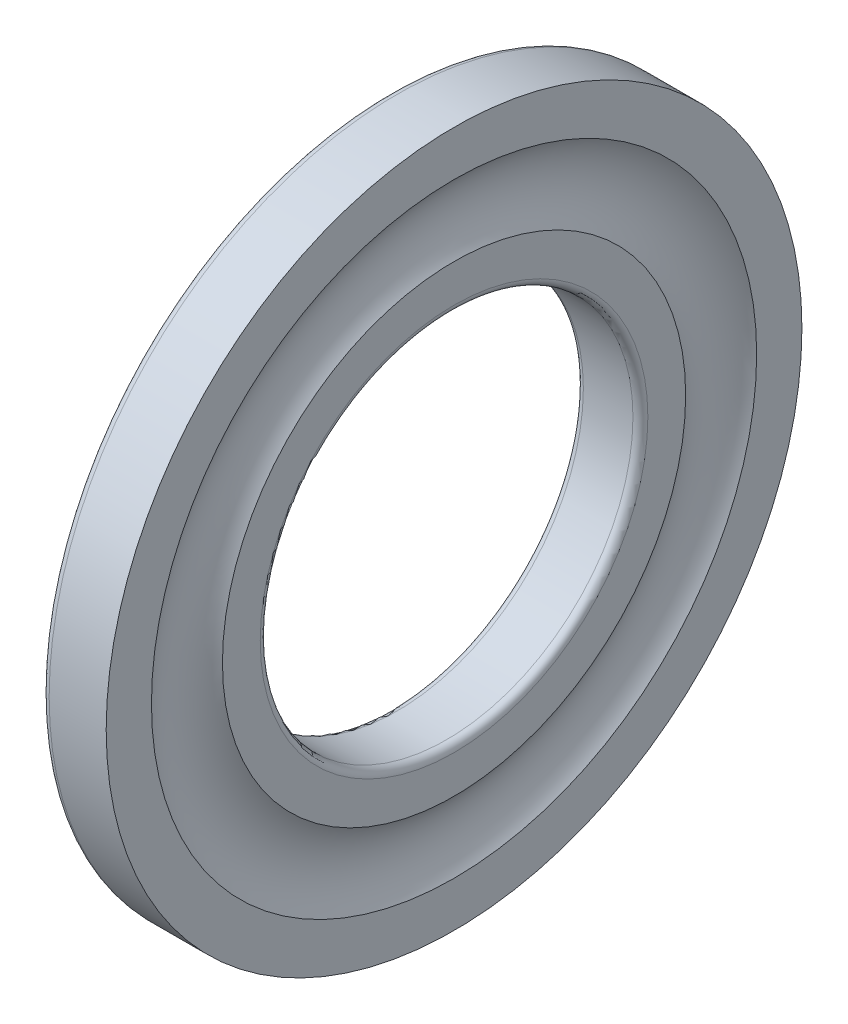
ISO-10303-21;
HEADER;
FILE_DESCRIPTION(('STEP AP214'),'2;1');
FILE_NAME('part.step','',(''),(''),'','','');
FILE_SCHEMA(('AUTOMOTIVE_DESIGN { 1 0 10303 214 1 1 1 1 }'));
ENDSEC;
DATA;
#1=APPLICATION_CONTEXT('core data for automotive mechanical design processes');
#2=APPLICATION_PROTOCOL_DEFINITION('international standard','automotive_design',2000,#1);
#3=PRODUCT_CONTEXT('',#1,'mechanical');
#4=PRODUCT('Part','Part','',(#3));
#5=PRODUCT_RELATED_PRODUCT_CATEGORY('part','',(#4));
#6=PRODUCT_DEFINITION_FORMATION('','',#4);
#7=PRODUCT_DEFINITION_CONTEXT('part definition',#1,'design');
#8=PRODUCT_DEFINITION('design','',#6,#7);
#9=PRODUCT_DEFINITION_SHAPE('','',#8);
#10=(LENGTH_UNIT() NAMED_UNIT(*) SI_UNIT(.MILLI.,.METRE.));
#11=(NAMED_UNIT(*) PLANE_ANGLE_UNIT() SI_UNIT($,.RADIAN.));
#12=(NAMED_UNIT(*) SI_UNIT($,.STERADIAN.) SOLID_ANGLE_UNIT());
#13=UNCERTAINTY_MEASURE_WITH_UNIT(LENGTH_MEASURE(1.E-05),#10,'distance_accuracy_value','');
#14=(GEOMETRIC_REPRESENTATION_CONTEXT(3) GLOBAL_UNCERTAINTY_ASSIGNED_CONTEXT((#13)) GLOBAL_UNIT_ASSIGNED_CONTEXT((#10,
#11,#12)) REPRESENTATION_CONTEXT('',''));
#15=CARTESIAN_POINT('',(0.,0.,0.));
#16=DIRECTION('',(0.,0.,1.));
#17=DIRECTION('',(1.,0.,0.));
#18=AXIS2_PLACEMENT_3D('',#15,#16,#17);
#19=CARTESIAN_POINT('',(0.,-13.9544959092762,-13.7));
#20=DIRECTION('',(-1.,0.,0.));
#21=DIRECTION('',(0.,0.,1.));
#22=AXIS2_PLACEMENT_3D('',#19,#20,#21);
#23=PLANE('',#22);
#24=CARTESIAN_POINT('',(0.,0.,0.));
#25=DIRECTION('',(-1.,0.,0.));
#26=DIRECTION('',(0.,0.,-1.));
#27=AXIS2_PLACEMENT_3D('',#24,#25,#26);
#28=CIRCLE('',#27,13.7);
#29=CARTESIAN_POINT('',(0.,0.,-13.7));
#30=VERTEX_POINT('',#29);
#31=EDGE_CURVE('E47',#30,#30,#28,.F.);
#32=ORIENTED_EDGE('',*,*,#31,.F.);
#33=EDGE_LOOP('',(#32));
#34=FACE_BOUND('',#33,.T.);
#35=CARTESIAN_POINT('',(0.,0.,0.));
#36=DIRECTION('',(1.,0.,0.));
#37=DIRECTION('',(0.,0.,1.));
#38=AXIS2_PLACEMENT_3D('',#35,#36,#37);
#39=CIRCLE('',#38,7.8);
#40=CARTESIAN_POINT('',(0.,0.,7.8));
#41=VERTEX_POINT('',#40);
#42=EDGE_CURVE('E44',#41,#41,#39,.T.);
#43=ORIENTED_EDGE('',*,*,#42,.T.);
#44=EDGE_LOOP('',(#43));
#45=FACE_BOUND('',#44,.T.);
#46=ADVANCED_FACE('F15',(#34,#45),#23,.T.);
#47=CARTESIAN_POINT('',(2.5952,-9.57609752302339,9.3214));
#48=DIRECTION('',(1.,0.,0.));
#49=DIRECTION('',(0.,0.,-1.));
#50=AXIS2_PLACEMENT_3D('',#47,#48,#49);
#51=PLANE('',#50);
#52=CARTESIAN_POINT('',(2.5952,0.,0.));
#53=DIRECTION('',(1.,0.,0.));
#54=DIRECTION('',(0.,-1.16848049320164E-09,1.));
#55=AXIS2_PLACEMENT_3D('',#52,#53,#54);
#56=CIRCLE('',#55,9.3214);
#57=CARTESIAN_POINT('',(2.5952,-1.08918740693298E-08,9.3214));
#58=VERTEX_POINT('',#57);
#59=EDGE_CURVE('E41',#58,#58,#56,.T.);
#60=ORIENTED_EDGE('',*,*,#59,.T.);
#61=EDGE_LOOP('',(#60));
#62=FACE_BOUND('',#61,.T.);
#63=CARTESIAN_POINT('',(2.5952,0.,0.));
#64=DIRECTION('',(-1.,0.,0.));
#65=DIRECTION('',(0.,0.,-1.));
#66=AXIS2_PLACEMENT_3D('',#63,#64,#65);
#67=CIRCLE('',#66,7.80000003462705);
#68=CARTESIAN_POINT('',(2.5952,0.,-7.80000003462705));
#69=VERTEX_POINT('',#68);
#70=EDGE_CURVE('E38',#69,#69,#67,.F.);
#71=ORIENTED_EDGE('',*,*,#70,.F.);
#72=EDGE_LOOP('',(#71));
#73=FACE_BOUND('',#72,.T.);
#74=ADVANCED_FACE('F55',(#62,#73),#51,.T.);
#75=CARTESIAN_POINT('',(2.5952,-14.260068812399,14.));
#76=DIRECTION('',(1.,0.,0.));
#77=DIRECTION('',(0.,0.,-1.));
#78=AXIS2_PLACEMENT_3D('',#75,#76,#77);
#79=PLANE('',#78);
#80=CARTESIAN_POINT('',(2.5952,0.,0.));
#81=DIRECTION('',(1.,0.,0.));
#82=DIRECTION('',(0.,0.,1.));
#83=AXIS2_PLACEMENT_3D('',#80,#81,#82);
#84=CIRCLE('',#83,14.);
#85=CARTESIAN_POINT('',(2.5952,0.,14.));
#86=VERTEX_POINT('',#85);
#87=EDGE_CURVE('E35',#86,#86,#84,.T.);
#88=ORIENTED_EDGE('',*,*,#87,.T.);
#89=EDGE_LOOP('',(#88));
#90=FACE_BOUND('',#89,.T.);
#91=CARTESIAN_POINT('',(2.5952,0.,0.));
#92=DIRECTION('',(-1.,0.,0.));
#93=DIRECTION('',(0.,0.,-1.));
#94=AXIS2_PLACEMENT_3D('',#91,#92,#93);
#95=CIRCLE('',#94,12.1786);
#96=CARTESIAN_POINT('',(2.5952,0.,-12.1786));
#97=VERTEX_POINT('',#96);
#98=EDGE_CURVE('E30',#97,#97,#95,.F.);
#99=ORIENTED_EDGE('',*,*,#98,.F.);
#100=EDGE_LOOP('',(#99));
#101=FACE_BOUND('',#100,.T.);
#102=ADVANCED_FACE('F62',(#90,#101),#79,.T.);
#103=CARTESIAN_POINT('',(0.299999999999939,0.,0.));
#104=DIRECTION('',(1.,0.,0.));
#105=DIRECTION('',(0.,0.,1.));
#106=AXIS2_PLACEMENT_3D('',#103,#104,#105);
#107=TOROIDAL_SURFACE('',#106,7.8,0.299999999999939);
#108=CARTESIAN_POINT('',(0.3,0.,0.));
#109=DIRECTION('',(1.,0.,0.));
#110=DIRECTION('',(0.,0.,1.));
#111=AXIS2_PLACEMENT_3D('',#108,#109,#110);
#112=CIRCLE('',#111,7.50000000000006);
#113=CARTESIAN_POINT('',(0.3,0.,7.50000000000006));
#114=VERTEX_POINT('',#113);
#115=EDGE_CURVE('E26',#114,#114,#112,.T.);
#116=ORIENTED_EDGE('',*,*,#115,.T.);
#117=EDGE_LOOP('',(#116));
#118=FACE_BOUND('',#117,.T.);
#119=ORIENTED_EDGE('',*,*,#42,.F.);
#120=EDGE_LOOP('',(#119));
#121=FACE_BOUND('',#120,.T.);
#122=ADVANCED_FACE('F59',(#118,#121),#107,.T.);
#123=CARTESIAN_POINT('',(2.5952,0.,0.));
#124=DIRECTION('',(1.,0.,0.));
#125=DIRECTION('',(0.,0.,1.));
#126=AXIS2_PLACEMENT_3D('',#123,#124,#125);
#127=CYLINDRICAL_SURFACE('',#126,7.5);
#128=CARTESIAN_POINT('',(2.2952,0.,0.));
#129=DIRECTION('',(1.,0.,0.));
#130=DIRECTION('',(0.,0.,1.));
#131=AXIS2_PLACEMENT_3D('',#128,#129,#130);
#132=CIRCLE('',#131,7.5);
#133=CARTESIAN_POINT('',(2.2952,0.,7.5));
#134=VERTEX_POINT('',#133);
#135=EDGE_CURVE('E22',#134,#134,#132,.T.);
#136=ORIENTED_EDGE('',*,*,#135,.T.);
#137=EDGE_LOOP('',(#136));
#138=FACE_BOUND('',#137,.T.);
#139=ORIENTED_EDGE('',*,*,#115,.F.);
#140=EDGE_LOOP('',(#139));
#141=FACE_BOUND('',#140,.T.);
#142=ADVANCED_FACE('F61',(#138,#141),#127,.F.);
#143=CARTESIAN_POINT('',(2.29520000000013,0.,0.));
#144=DIRECTION('',(1.,0.,0.));
#145=DIRECTION('',(0.,0.,1.));
#146=AXIS2_PLACEMENT_3D('',#143,#144,#145);
#147=TOROIDAL_SURFACE('',#146,7.79999999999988,0.299999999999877);
#148=ORIENTED_EDGE('',*,*,#70,.T.);
#149=EDGE_LOOP('',(#148));
#150=FACE_BOUND('',#149,.T.);
#151=ORIENTED_EDGE('',*,*,#135,.F.);
#152=EDGE_LOOP('',(#151));
#153=FACE_BOUND('',#152,.T.);
#154=ADVANCED_FACE('F70',(#150,#153),#147,.T.);
#155=CARTESIAN_POINT('',(4.5,0.,0.));
#156=DIRECTION('',(1.,0.,0.));
#157=DIRECTION('',(0.,0.,1.));
#158=AXIS2_PLACEMENT_3D('',#155,#156,#157);
#159=TOROIDAL_SURFACE('',#158,10.75,2.381);
#160=ORIENTED_EDGE('',*,*,#59,.F.);
#161=EDGE_LOOP('',(#160));
#162=FACE_BOUND('',#161,.T.);
#163=ORIENTED_EDGE('',*,*,#98,.T.);
#164=EDGE_LOOP('',(#163));
#165=FACE_BOUND('',#164,.T.);
#166=ADVANCED_FACE('F78',(#162,#165),#159,.F.);
#167=CARTESIAN_POINT('',(2.5952,0.,0.));
#168=DIRECTION('',(1.,0.,0.));
#169=DIRECTION('',(0.,0.,1.));
#170=AXIS2_PLACEMENT_3D('',#167,#168,#169);
#171=CYLINDRICAL_SURFACE('',#170,14.);
#172=CARTESIAN_POINT('',(0.3,0.,0.));
#173=DIRECTION('',(1.,0.,0.));
#174=DIRECTION('',(0.,0.,1.));
#175=AXIS2_PLACEMENT_3D('',#172,#173,#174);
#176=CIRCLE('',#175,14.);
#177=CARTESIAN_POINT('',(0.3,0.,14.));
#178=VERTEX_POINT('',#177);
#179=EDGE_CURVE('E10',#178,#178,#176,.T.);
#180=ORIENTED_EDGE('',*,*,#179,.T.);
#181=EDGE_LOOP('',(#180));
#182=FACE_BOUND('',#181,.T.);
#183=ORIENTED_EDGE('',*,*,#87,.F.);
#184=EDGE_LOOP('',(#183));
#185=FACE_BOUND('',#184,.T.);
#186=ADVANCED_FACE('F81',(#182,#185),#171,.T.);
#187=CARTESIAN_POINT('',(0.299999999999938,0.,0.));
#188=DIRECTION('',(1.,0.,0.));
#189=DIRECTION('',(0.,0.,1.));
#190=AXIS2_PLACEMENT_3D('',#187,#188,#189);
#191=TOROIDAL_SURFACE('',#190,13.7,0.299999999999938);
#192=ORIENTED_EDGE('',*,*,#31,.T.);
#193=EDGE_LOOP('',(#192));
#194=FACE_BOUND('',#193,.T.);
#195=ORIENTED_EDGE('',*,*,#179,.F.);
#196=EDGE_LOOP('',(#195));
#197=FACE_BOUND('',#196,.T.);
#198=ADVANCED_FACE('F17',(#194,#197),#191,.T.);
#199=CLOSED_SHELL('',(#46,#74,#102,#122,#142,#154,#166,#186,#198));
#200=MANIFOLD_SOLID_BREP('B1',#199);
#201=ADVANCED_BREP_SHAPE_REPRESENTATION('',(#18,#200),#14);
#202=SHAPE_DEFINITION_REPRESENTATION(#9,#201);
ENDSEC;
END-ISO-10303-21;
